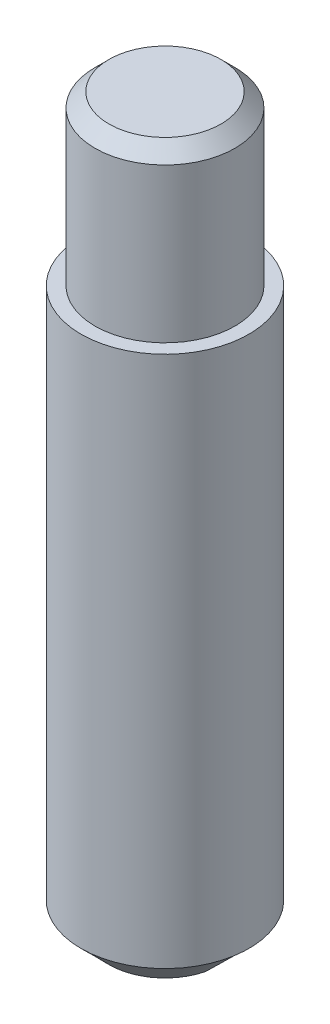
from build123d import *

# Parameters (mm, degrees)
SKETCH1_R      = 3
EXTRUDE1_DEPTH = 26
SKETCH2_R      = 6.881580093
SKETCH2_R_2    = 2.5
EXTRUDE2_DEPTH = 6
CHAMFER1_SIZE  = 0.5
CHAMFER2_SIZE  = 1
EXTRUDE3_DEPTH = 1


with BuildPart() as part:
    # Sketch1 → Extrude1 (new body)
    with BuildSketch(Plane(origin=(0, 0, 0), x_dir=(1, 0, 0), z_dir=(0, 1, 0))):
        with Locations(Location((0, 0, 0), (0, 0, 90))):
            Circle(SKETCH1_R)
    extrude(amount=EXTRUDE1_DEPTH)

    # Sketch2 → Extrude2 (cut)
    with BuildSketch(Plane(origin=(0, 26, 0), x_dir=(1, 0, 0), z_dir=(0, 1, 0))):
        Circle(SKETCH2_R)
        with Locations(Location((0, 0, 0), (0, 0, 270))):
            Circle(SKETCH2_R_2, mode=Mode.SUBTRACT)
    extrude(amount=-EXTRUDE2_DEPTH, mode=Mode.SUBTRACT)

    # Chamfer1
    chamfer1_edges = [part.edges().sort_by_distance(p)[0] for p in [
        (0, 26, -2.5),
    ]]
    chamfer(chamfer1_edges, length=CHAMFER1_SIZE)

    # Chamfer2
    chamfer2_edges = [part.edges().sort_by_distance(p)[0] for p in [
        (0, 0, 3),
    ]]
    chamfer(chamfer2_edges, length=CHAMFER2_SIZE)

    # Sketch3 → Extrude3 (cut)
    with BuildSketch(Plane.XZ):
        Polygon((-4.086032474, -0.5), (4.144404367, -0.5), (4.222233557, 0.5), (-4.008203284, 0.5), align=None)
    extrude(amount=-EXTRUDE3_DEPTH, mode=Mode.SUBTRACT)


solid = part.part
